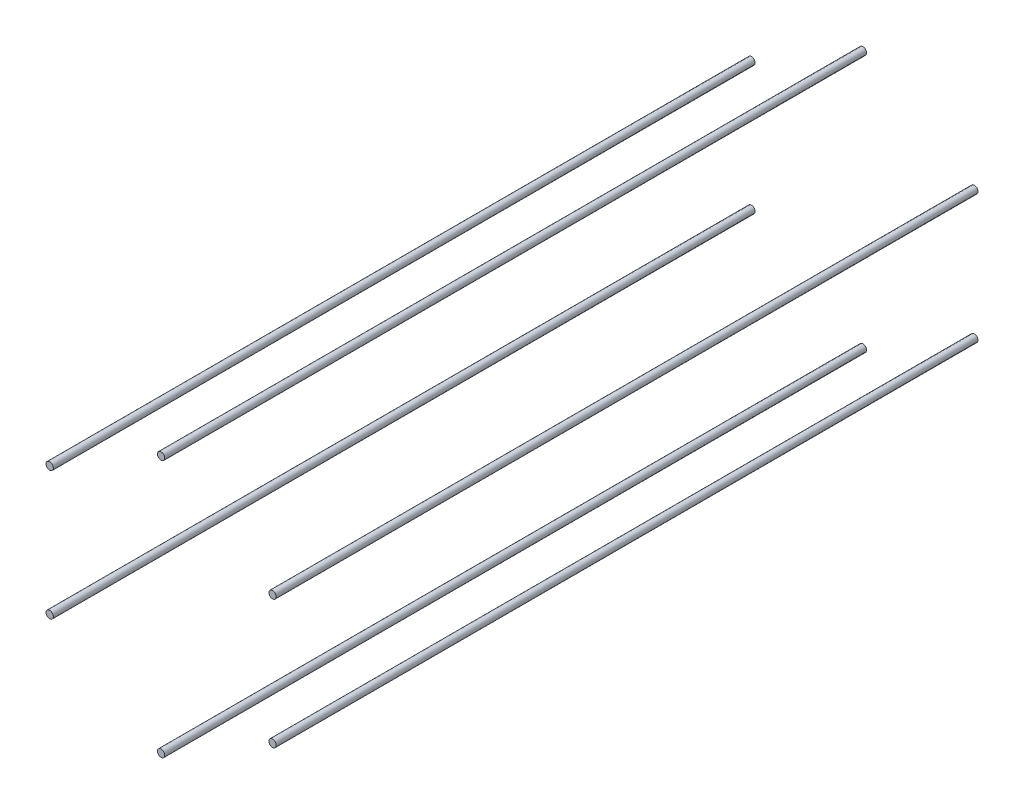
from build123d import *

# Parameters (mm, degrees)
SKETCH2_R             = 6.35
BOSS_EXTRUDE1_DEPTH   = 609.6
BOSS_EXTRUDE1_2_DEPTH = 609.6
BOSS_EXTRUDE1_3_DEPTH = 609.6
BOSS_EXTRUDE1_4_DEPTH = 609.6
BOSS_EXTRUDE1_5_DEPTH = 609.6
BOSS_EXTRUDE1_6_DEPTH = 609.6


with BuildPart() as part:
    # Sketch2 → Boss-Extrude1 (new, symmetric)
    with BuildSketch(Plane(origin=(0, 0, 0), x_dir=(0, 1, 0), z_dir=(0, 0, 1))):
        with Locations(Location((223.528704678, 0, 0), (0, 0, 90))):
            Circle(SKETCH2_R)
    extrude(amount=BOSS_EXTRUDE1_DEPTH, both=True)


with BuildPart() as body_2:
    # Sketch2 → Boss-Extrude1 2 (new, symmetric)
    with BuildSketch(Plane(origin=(0, 0, 0), x_dir=(0, 1, 0), z_dir=(0, 0, 1))):
        with Locations(Location((111.764352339, -193.581536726, 0), (0, 0, 90))):
            Circle(SKETCH2_R)
    extrude(amount=BOSS_EXTRUDE1_2_DEPTH, both=True)


with BuildPart() as body_3:
    # Sketch2 → Boss-Extrude1 3 (new, symmetric)
    with BuildSketch(Plane(origin=(0, 0, 0), x_dir=(0, 1, 0), z_dir=(0, 0, 1))):
        with Locations(Location((-111.764352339, -193.581536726, 0), (0, 0, 90))):
            Circle(SKETCH2_R)
    extrude(amount=BOSS_EXTRUDE1_3_DEPTH, both=True)


with BuildPart() as body_4:
    # Sketch2 → Boss-Extrude1 4 (new, symmetric)
    with BuildSketch(Plane(origin=(0, 0, 0), x_dir=(0, 1, 0), z_dir=(0, 0, 1))):
        with Locations(Location((-223.528704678, 0, 0), (0, 0, 90))):
            Circle(SKETCH2_R)
    extrude(amount=BOSS_EXTRUDE1_4_DEPTH, both=True)


with BuildPart() as body_5:
    # Sketch2 → Boss-Extrude1 5 (new, symmetric)
    with BuildSketch(Plane(origin=(0, 0, 0), x_dir=(0, 1, 0), z_dir=(0, 0, 1))):
        with Locations(Location((-111.764352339, 193.581536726, 0), (0, 0, 90))):
            Circle(SKETCH2_R)
    extrude(amount=BOSS_EXTRUDE1_5_DEPTH, both=True)


with BuildPart() as body_6:
    # Sketch2 → Boss-Extrude1 6 (new, symmetric)
    with BuildSketch(Plane(origin=(0, 0, 0), x_dir=(0, 1, 0), z_dir=(0, 0, 1))):
        with Locations(Location((111.764352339, 193.581536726, 0), (0, 0, 90))):
            Circle(SKETCH2_R)
    extrude(amount=BOSS_EXTRUDE1_6_DEPTH, both=True)


solid = Compound([part.part, body_2.part, body_3.part, body_4.part, body_5.part, body_6.part])
